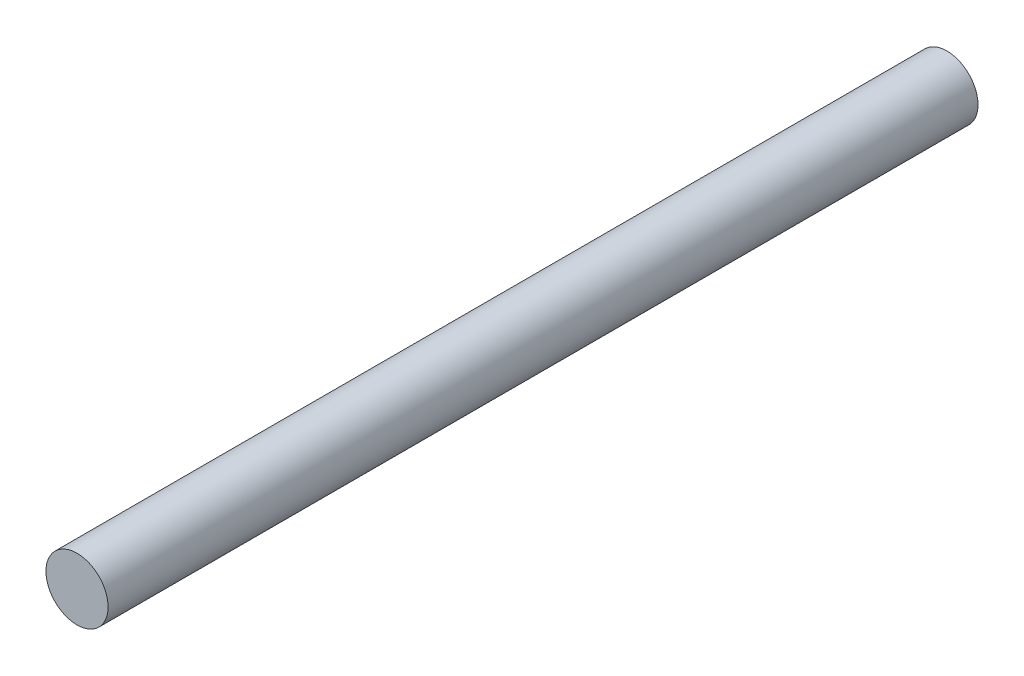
ISO-10303-21;
HEADER;
FILE_DESCRIPTION(('STEP AP214'),'2;1');
FILE_NAME('part.step','',(''),(''),'','','');
FILE_SCHEMA(('AUTOMOTIVE_DESIGN { 1 0 10303 214 1 1 1 1 }'));
ENDSEC;
DATA;
#1=APPLICATION_CONTEXT('core data for automotive mechanical design processes');
#2=APPLICATION_PROTOCOL_DEFINITION('international standard','automotive_design',2000,#1);
#3=PRODUCT_CONTEXT('',#1,'mechanical');
#4=PRODUCT('Part','Part','',(#3));
#5=PRODUCT_RELATED_PRODUCT_CATEGORY('part','',(#4));
#6=PRODUCT_DEFINITION_FORMATION('','',#4);
#7=PRODUCT_DEFINITION_CONTEXT('part definition',#1,'design');
#8=PRODUCT_DEFINITION('design','',#6,#7);
#9=PRODUCT_DEFINITION_SHAPE('','',#8);
#10=(LENGTH_UNIT() NAMED_UNIT(*) SI_UNIT(.MILLI.,.METRE.));
#11=(NAMED_UNIT(*) PLANE_ANGLE_UNIT() SI_UNIT($,.RADIAN.));
#12=(NAMED_UNIT(*) SI_UNIT($,.STERADIAN.) SOLID_ANGLE_UNIT());
#13=UNCERTAINTY_MEASURE_WITH_UNIT(LENGTH_MEASURE(1.E-05),#10,'distance_accuracy_value','');
#14=(GEOMETRIC_REPRESENTATION_CONTEXT(3) GLOBAL_UNCERTAINTY_ASSIGNED_CONTEXT((#13)) GLOBAL_UNIT_ASSIGNED_CONTEXT((#10,
#11,#12)) REPRESENTATION_CONTEXT('',''));
#15=CARTESIAN_POINT('',(0.,0.,0.));
#16=DIRECTION('',(0.,0.,1.));
#17=DIRECTION('',(1.,0.,0.));
#18=AXIS2_PLACEMENT_3D('',#15,#16,#17);
#19=CARTESIAN_POINT('',(0.,0.,400.));
#20=DIRECTION('',(0.,0.,-1.));
#21=DIRECTION('',(-1.,0.,0.));
#22=AXIS2_PLACEMENT_3D('',#19,#20,#21);
#23=CYLINDRICAL_SURFACE('',#22,14.2875);
#24=CARTESIAN_POINT('',(0.,0.,400.));
#25=DIRECTION('',(0.,0.,1.));
#26=DIRECTION('',(1.,0.,0.));
#27=AXIS2_PLACEMENT_3D('',#24,#25,#26);
#28=CIRCLE('',#27,14.2875);
#29=CARTESIAN_POINT('',(14.2875,0.,400.));
#30=VERTEX_POINT('',#29);
#31=EDGE_CURVE('E10',#30,#30,#28,.T.);
#32=ORIENTED_EDGE('',*,*,#31,.F.);
#33=EDGE_LOOP('',(#32));
#34=FACE_BOUND('',#33,.T.);
#35=CARTESIAN_POINT('',(0.,0.,0.));
#36=DIRECTION('',(0.,0.,1.));
#37=DIRECTION('',(1.,0.,0.));
#38=AXIS2_PLACEMENT_3D('',#35,#36,#37);
#39=CIRCLE('',#38,14.2875);
#40=CARTESIAN_POINT('',(14.2875,0.,0.));
#41=VERTEX_POINT('',#40);
#42=EDGE_CURVE('E34',#41,#41,#39,.T.);
#43=ORIENTED_EDGE('',*,*,#42,.T.);
#44=EDGE_LOOP('',(#43));
#45=FACE_BOUND('',#44,.T.);
#46=ADVANCED_FACE('F31',(#34,#45),#23,.T.);
#47=CARTESIAN_POINT('',(0.,0.,400.));
#48=DIRECTION('',(0.,0.,1.));
#49=DIRECTION('',(1.,0.,0.));
#50=AXIS2_PLACEMENT_3D('',#47,#48,#49);
#51=PLANE('',#50);
#52=ORIENTED_EDGE('',*,*,#31,.T.);
#53=EDGE_LOOP('',(#52));
#54=FACE_BOUND('',#53,.T.);
#55=ADVANCED_FACE('F46',(#54),#51,.T.);
#56=CARTESIAN_POINT('',(0.,0.,0.));
#57=DIRECTION('',(0.,0.,1.));
#58=DIRECTION('',(1.,0.,0.));
#59=AXIS2_PLACEMENT_3D('',#56,#57,#58);
#60=PLANE('',#59);
#61=ORIENTED_EDGE('',*,*,#42,.F.);
#62=EDGE_LOOP('',(#61));
#63=FACE_BOUND('',#62,.T.);
#64=ADVANCED_FACE('F44',(#63),#60,.F.);
#65=CLOSED_SHELL('',(#46,#55,#64));
#66=MANIFOLD_SOLID_BREP('B2',#65);
#67=ADVANCED_BREP_SHAPE_REPRESENTATION('',(#18,#66),#14);
#68=SHAPE_DEFINITION_REPRESENTATION(#9,#67);
ENDSEC;
END-ISO-10303-21;
